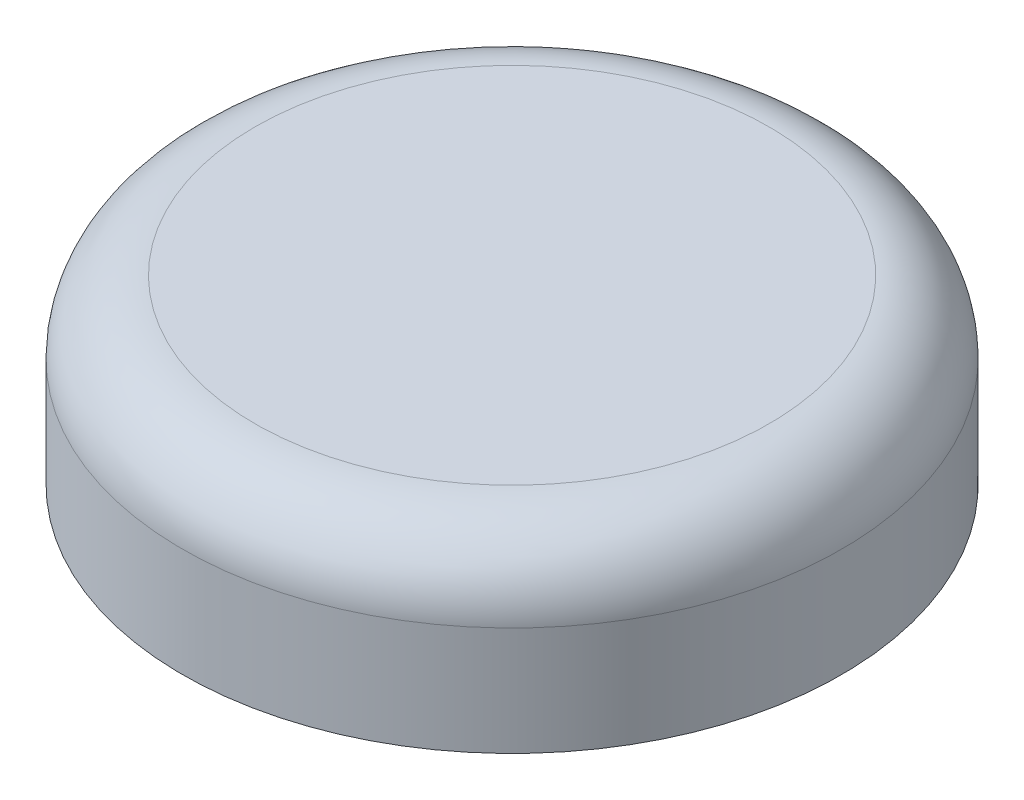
from build123d import *


with BuildPart() as part:
    # Esquisse1 → R_volution1 (revolve)
    with BuildSketch(Plane.XY):
        with BuildLine():
            Line((-2, 3), (-7.1, 3))
            Line((-7.1, 3), (-7.1, 1))
            Line((-7.1, 1), (-8.1, 0))
            Line((-8.1, 0), (-9.1, 0))
            Line((-9.1, 0), (-9.1, 3))
            ThreePointArc((-9.1, 3), (-8.514213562, 4.414213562), (-7.1, 5))
            Line((-7.1, 5), (0, 5))
            Line((0, 5), (0, 3))
            Line((0, 3), (0, -2))
            Line((0, -2), (-1, -2))
            Line((-1, -2), (-2, -1))
            Line((-2, -1), (-2, 3))
        make_face()
    revolve(axis=Axis((0, 5, 0), (0, -1, 0)))


solid = part.part
